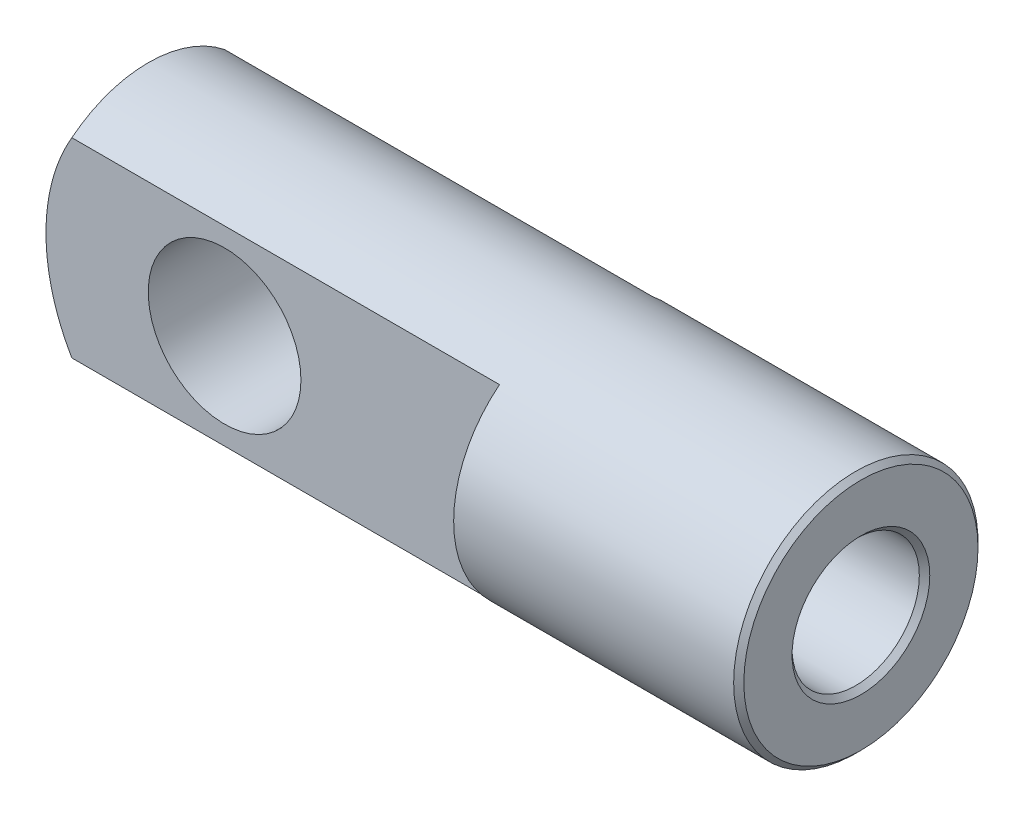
ISO-10303-21;
HEADER;
FILE_DESCRIPTION(('STEP AP214'),'2;1');
FILE_NAME('part.step','',(''),(''),'','','');
FILE_SCHEMA(('AUTOMOTIVE_DESIGN { 1 0 10303 214 1 1 1 1 }'));
ENDSEC;
DATA;
#1=APPLICATION_CONTEXT('core data for automotive mechanical design processes');
#2=APPLICATION_PROTOCOL_DEFINITION('international standard','automotive_design',2000,#1);
#3=PRODUCT_CONTEXT('',#1,'mechanical');
#4=PRODUCT('Part','Part','',(#3));
#5=PRODUCT_RELATED_PRODUCT_CATEGORY('part','',(#4));
#6=PRODUCT_DEFINITION_FORMATION('','',#4);
#7=PRODUCT_DEFINITION_CONTEXT('part definition',#1,'design');
#8=PRODUCT_DEFINITION('design','',#6,#7);
#9=PRODUCT_DEFINITION_SHAPE('','',#8);
#10=(LENGTH_UNIT() NAMED_UNIT(*) SI_UNIT(.MILLI.,.METRE.));
#11=(NAMED_UNIT(*) PLANE_ANGLE_UNIT() SI_UNIT($,.RADIAN.));
#12=(NAMED_UNIT(*) SI_UNIT($,.STERADIAN.) SOLID_ANGLE_UNIT());
#13=UNCERTAINTY_MEASURE_WITH_UNIT(LENGTH_MEASURE(1.E-05),#10,'distance_accuracy_value','');
#14=(GEOMETRIC_REPRESENTATION_CONTEXT(3) GLOBAL_UNCERTAINTY_ASSIGNED_CONTEXT((#13)) GLOBAL_UNIT_ASSIGNED_CONTEXT((#10,
#11,#12)) REPRESENTATION_CONTEXT('',''));
#15=CARTESIAN_POINT('',(0.,0.,0.));
#16=DIRECTION('',(0.,0.,1.));
#17=DIRECTION('',(1.,0.,0.));
#18=AXIS2_PLACEMENT_3D('',#15,#16,#17);
#19=CARTESIAN_POINT('',(-108.,0.,0.));
#20=DIRECTION('',(-1.,0.,0.));
#21=DIRECTION('',(0.,1.,0.));
#22=AXIS2_PLACEMENT_3D('',#19,#20,#21);
#23=SPHERICAL_SURFACE('',#22,40.);
#24=CARTESIAN_POINT('',(-148.,0.,0.));
#25=VERTEX_POINT('',#24);
#26=VERTEX_LOOP('',#25);
#27=FACE_BOUND('',#26,.T.);
#28=CARTESIAN_POINT('',(-140.,0.,0.));
#29=DIRECTION('',(-1.,0.,0.));
#30=DIRECTION('',(0.,0.,1.));
#31=AXIS2_PLACEMENT_3D('',#28,#29,#30);
#32=CIRCLE('',#31,24.);
#33=CARTESIAN_POINT('',(-140.,18.7349939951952,15.));
#34=VERTEX_POINT('',#33);
#35=CARTESIAN_POINT('',(-140.,18.7349939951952,-15.));
#36=VERTEX_POINT('',#35);
#37=EDGE_CURVE('E122',#34,#36,#32,.T.);
#38=ORIENTED_EDGE('',*,*,#37,.T.);
#39=CARTESIAN_POINT('',(-108.,0.,-15.));
#40=DIRECTION('',(0.,0.,1.));
#41=DIRECTION('',(1.,0.,0.));
#42=AXIS2_PLACEMENT_3D('',#39,#40,#41);
#43=CIRCLE('',#42,37.0809924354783);
#44=CARTESIAN_POINT('',(-140.,-18.7349939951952,-15.));
#45=VERTEX_POINT('',#44);
#46=EDGE_CURVE('E112',#36,#45,#43,.T.);
#47=ORIENTED_EDGE('',*,*,#46,.T.);
#48=CARTESIAN_POINT('',(-140.,-18.7349939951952,15.));
#49=VERTEX_POINT('',#48);
#50=EDGE_CURVE('E121',#45,#49,#32,.T.);
#51=ORIENTED_EDGE('',*,*,#50,.T.);
#52=CARTESIAN_POINT('',(-108.,0.,15.));
#53=DIRECTION('',(0.,0.,-1.));
#54=DIRECTION('',(-1.,0.,0.));
#55=AXIS2_PLACEMENT_3D('',#52,#53,#54);
#56=CIRCLE('',#55,37.0809924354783);
#57=EDGE_CURVE('E108',#49,#34,#56,.T.);
#58=ORIENTED_EDGE('',*,*,#57,.T.);
#59=EDGE_LOOP('',(#38,#47,#51,#58));
#60=FACE_BOUND('',#59,.T.);
#61=ADVANCED_FACE('F42',(#27,#60),#23,.T.);
#62=CARTESIAN_POINT('',(-148.,0.,0.));
#63=DIRECTION('',(-1.,0.,0.));
#64=DIRECTION('',(0.,0.,1.));
#65=AXIS2_PLACEMENT_3D('',#62,#63,#64);
#66=CYLINDRICAL_SURFACE('',#65,24.);
#67=CARTESIAN_POINT('',(-56.,0.,0.));
#68=DIRECTION('',(1.,0.,0.));
#69=DIRECTION('',(0.,0.,-1.));
#70=AXIS2_PLACEMENT_3D('',#67,#68,#69);
#71=CIRCLE('',#70,24.);
#72=CARTESIAN_POINT('',(-56.,-18.7349939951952,-15.));
#73=VERTEX_POINT('',#72);
#74=CARTESIAN_POINT('',(-56.,18.7349939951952,-15.));
#75=VERTEX_POINT('',#74);
#76=EDGE_CURVE('E49',#73,#75,#71,.T.);
#77=ORIENTED_EDGE('',*,*,#76,.T.);
#78=DIRECTION('',(-1.,0.,0.));
#79=VECTOR('',#78,1.);
#80=CARTESIAN_POINT('',(-148.,18.7349939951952,-15.));
#81=LINE('',#80,#79);
#82=EDGE_CURVE('E12',#75,#36,#81,.T.);
#83=ORIENTED_EDGE('',*,*,#82,.T.);
#84=ORIENTED_EDGE('',*,*,#37,.F.);
#85=DIRECTION('',(-1.,0.,0.));
#86=VECTOR('',#85,1.);
#87=CARTESIAN_POINT('',(-148.,18.7349939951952,15.));
#88=LINE('',#87,#86);
#89=CARTESIAN_POINT('',(-56.,18.7349939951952,15.));
#90=VERTEX_POINT('',#89);
#91=EDGE_CURVE('E125',#34,#90,#88,.F.);
#92=ORIENTED_EDGE('',*,*,#91,.T.);
#93=CARTESIAN_POINT('',(-56.,0.,0.));
#94=DIRECTION('',(1.,0.,0.));
#95=DIRECTION('',(0.,0.,-1.));
#96=AXIS2_PLACEMENT_3D('',#93,#94,#95);
#97=CIRCLE('',#96,24.);
#98=CARTESIAN_POINT('',(-56.,-18.7349939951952,15.));
#99=VERTEX_POINT('',#98);
#100=EDGE_CURVE('E128',#90,#99,#97,.T.);
#101=ORIENTED_EDGE('',*,*,#100,.T.);
#102=DIRECTION('',(-1.,0.,0.));
#103=VECTOR('',#102,1.);
#104=CARTESIAN_POINT('',(-148.,-18.7349939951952,15.));
#105=LINE('',#104,#103);
#106=EDGE_CURVE('E131',#99,#49,#105,.T.);
#107=ORIENTED_EDGE('',*,*,#106,.T.);
#108=ORIENTED_EDGE('',*,*,#50,.F.);
#109=DIRECTION('',(-1.,0.,0.));
#110=VECTOR('',#109,1.);
#111=CARTESIAN_POINT('',(-148.,-18.7349939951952,-15.));
#112=LINE('',#111,#110);
#113=EDGE_CURVE('E134',#45,#73,#112,.F.);
#114=ORIENTED_EDGE('',*,*,#113,.T.);
#115=EDGE_LOOP('',(#77,#83,#84,#92,#101,#107,#108,#114));
#116=FACE_BOUND('',#115,.T.);
#117=CARTESIAN_POINT('',(-1.,0.,0.));
#118=DIRECTION('',(-1.,0.,0.));
#119=DIRECTION('',(0.,0.,1.));
#120=AXIS2_PLACEMENT_3D('',#117,#118,#119);
#121=CIRCLE('',#120,24.);
#122=CARTESIAN_POINT('',(-1.,0.,24.));
#123=VERTEX_POINT('',#122);
#124=EDGE_CURVE('E118',#123,#123,#121,.T.);
#125=ORIENTED_EDGE('',*,*,#124,.T.);
#126=EDGE_LOOP('',(#125));
#127=FACE_BOUND('',#126,.T.);
#128=ADVANCED_FACE('F138',(#116,#127),#66,.T.);
#129=CARTESIAN_POINT('',(0.,0.,0.));
#130=DIRECTION('',(-1.,0.,0.));
#131=DIRECTION('',(0.,0.,1.));
#132=AXIS2_PLACEMENT_3D('',#129,#130,#131);
#133=CONICAL_SURFACE('',#132,23.,0.785398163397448);
#134=ORIENTED_EDGE('',*,*,#124,.F.);
#135=EDGE_LOOP('',(#134));
#136=FACE_BOUND('',#135,.T.);
#137=CARTESIAN_POINT('',(0.,0.,0.));
#138=DIRECTION('',(-1.,0.,0.));
#139=DIRECTION('',(0.,0.,1.));
#140=AXIS2_PLACEMENT_3D('',#137,#138,#139);
#141=CIRCLE('',#140,23.);
#142=CARTESIAN_POINT('',(0.,0.,23.));
#143=VERTEX_POINT('',#142);
#144=EDGE_CURVE('E115',#143,#143,#141,.T.);
#145=ORIENTED_EDGE('',*,*,#144,.T.);
#146=EDGE_LOOP('',(#145));
#147=FACE_BOUND('',#146,.T.);
#148=ADVANCED_FACE('F162',(#136,#147),#133,.T.);
#149=CARTESIAN_POINT('',(0.,0.,0.));
#150=DIRECTION('',(-1.,0.,0.));
#151=DIRECTION('',(0.,0.,1.));
#152=AXIS2_PLACEMENT_3D('',#149,#150,#151);
#153=PLANE('',#152);
#154=CARTESIAN_POINT('',(0.,0.,0.));
#155=DIRECTION('',(1.,0.,0.));
#156=DIRECTION('',(0.,0.,-1.));
#157=AXIS2_PLACEMENT_3D('',#154,#155,#156);
#158=CIRCLE('',#157,13.525);
#159=CARTESIAN_POINT('',(0.,0.,-13.525));
#160=VERTEX_POINT('',#159);
#161=EDGE_CURVE('E100',#160,#160,#158,.T.);
#162=ORIENTED_EDGE('',*,*,#161,.F.);
#163=EDGE_LOOP('',(#162));
#164=FACE_BOUND('',#163,.T.);
#165=ORIENTED_EDGE('',*,*,#144,.F.);
#166=EDGE_LOOP('',(#165));
#167=FACE_BOUND('',#166,.T.);
#168=ADVANCED_FACE('F169',(#164,#167),#153,.F.);
#169=CARTESIAN_POINT('',(-148.,-30.,15.));
#170=DIRECTION('',(0.,0.,-1.));
#171=DIRECTION('',(-1.,0.,0.));
#172=AXIS2_PLACEMENT_3D('',#169,#170,#171);
#173=PLANE('',#172);
#174=CARTESIAN_POINT('',(-110.,0.,15.));
#175=DIRECTION('',(0.,0.,1.));
#176=DIRECTION('',(1.,0.,0.));
#177=AXIS2_PLACEMENT_3D('',#174,#175,#176);
#178=CIRCLE('',#177,15.);
#179=CARTESIAN_POINT('',(-95.,0.,15.));
#180=VERTEX_POINT('',#179);
#181=EDGE_CURVE('E93',#180,#180,#178,.T.);
#182=ORIENTED_EDGE('',*,*,#181,.F.);
#183=EDGE_LOOP('',(#182));
#184=FACE_BOUND('',#183,.T.);
#185=DIRECTION('',(0.,1.,0.));
#186=VECTOR('',#185,1.);
#187=CARTESIAN_POINT('',(-56.,-30.,15.));
#188=LINE('',#187,#186);
#189=EDGE_CURVE('E105',#99,#90,#188,.T.);
#190=ORIENTED_EDGE('',*,*,#189,.T.);
#191=ORIENTED_EDGE('',*,*,#91,.F.);
#192=ORIENTED_EDGE('',*,*,#57,.F.);
#193=ORIENTED_EDGE('',*,*,#106,.F.);
#194=EDGE_LOOP('',(#190,#191,#192,#193));
#195=FACE_BOUND('',#194,.T.);
#196=ADVANCED_FACE('F154',(#184,#195),#173,.F.);
#197=CARTESIAN_POINT('',(-56.,-30.,15.));
#198=DIRECTION('',(1.,0.,0.));
#199=DIRECTION('',(0.,0.,-1.));
#200=AXIS2_PLACEMENT_3D('',#197,#198,#199);
#201=PLANE('',#200);
#202=ORIENTED_EDGE('',*,*,#189,.F.);
#203=ORIENTED_EDGE('',*,*,#100,.F.);
#204=EDGE_LOOP('',(#202,#203));
#205=FACE_BOUND('',#204,.T.);
#206=ADVANCED_FACE('F146',(#205),#201,.F.);
#207=CARTESIAN_POINT('',(-56.,-30.,-15.));
#208=DIRECTION('',(1.,0.,0.));
#209=DIRECTION('',(0.,0.,-1.));
#210=AXIS2_PLACEMENT_3D('',#207,#208,#209);
#211=PLANE('',#210);
#212=DIRECTION('',(0.,1.,0.));
#213=VECTOR('',#212,1.);
#214=CARTESIAN_POINT('',(-56.,-30.,-15.));
#215=LINE('',#214,#213);
#216=EDGE_CURVE('E59',#73,#75,#215,.T.);
#217=ORIENTED_EDGE('',*,*,#216,.T.);
#218=ORIENTED_EDGE('',*,*,#76,.F.);
#219=EDGE_LOOP('',(#217,#218));
#220=FACE_BOUND('',#219,.T.);
#221=ADVANCED_FACE('F143',(#220),#211,.F.);
#222=CARTESIAN_POINT('',(-148.,-30.,-15.));
#223=DIRECTION('',(0.,0.,1.));
#224=DIRECTION('',(1.,0.,0.));
#225=AXIS2_PLACEMENT_3D('',#222,#223,#224);
#226=PLANE('',#225);
#227=CARTESIAN_POINT('',(-110.,0.,-15.));
#228=DIRECTION('',(0.,0.,1.));
#229=DIRECTION('',(1.,0.,0.));
#230=AXIS2_PLACEMENT_3D('',#227,#228,#229);
#231=CIRCLE('',#230,15.);
#232=CARTESIAN_POINT('',(-95.,0.,-15.));
#233=VERTEX_POINT('',#232);
#234=EDGE_CURVE('E97',#233,#233,#231,.T.);
#235=ORIENTED_EDGE('',*,*,#234,.T.);
#236=EDGE_LOOP('',(#235));
#237=FACE_BOUND('',#236,.T.);
#238=ORIENTED_EDGE('',*,*,#216,.F.);
#239=ORIENTED_EDGE('',*,*,#113,.F.);
#240=ORIENTED_EDGE('',*,*,#46,.F.);
#241=ORIENTED_EDGE('',*,*,#82,.F.);
#242=EDGE_LOOP('',(#238,#239,#240,#241));
#243=FACE_BOUND('',#242,.T.);
#244=ADVANCED_FACE('F145',(#237,#243),#226,.F.);
#245=CARTESIAN_POINT('',(-110.,0.,-15.));
#246=DIRECTION('',(0.,0.,1.));
#247=DIRECTION('',(1.,0.,0.));
#248=AXIS2_PLACEMENT_3D('',#245,#246,#247);
#249=CYLINDRICAL_SURFACE('',#248,15.);
#250=ORIENTED_EDGE('',*,*,#234,.F.);
#251=EDGE_LOOP('',(#250));
#252=FACE_BOUND('',#251,.T.);
#253=ORIENTED_EDGE('',*,*,#181,.T.);
#254=EDGE_LOOP('',(#253));
#255=FACE_BOUND('',#254,.T.);
#256=ADVANCED_FACE('F87',(#252,#255),#249,.F.);
#257=CARTESIAN_POINT('',(-35.5,0.,0.));
#258=DIRECTION('',(1.,0.,0.));
#259=DIRECTION('',(0.,0.,-1.));
#260=AXIS2_PLACEMENT_3D('',#257,#258,#259);
#261=CONICAL_SURFACE('',#260,12.5,1.02974425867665);
#262=CARTESIAN_POINT('',(-43.0107577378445,0.,0.));
#263=VERTEX_POINT('',#262);
#264=VERTEX_LOOP('',#263);
#265=FACE_BOUND('',#264,.T.);
#266=CARTESIAN_POINT('',(-35.5,0.,0.));
#267=DIRECTION('',(1.,0.,0.));
#268=DIRECTION('',(0.,0.,-1.));
#269=AXIS2_PLACEMENT_3D('',#266,#267,#268);
#270=CIRCLE('',#269,12.5);
#271=CARTESIAN_POINT('',(-35.5,0.,-12.5));
#272=VERTEX_POINT('',#271);
#273=EDGE_CURVE('E91',#272,#272,#270,.T.);
#274=ORIENTED_EDGE('',*,*,#273,.T.);
#275=EDGE_LOOP('',(#274));
#276=FACE_BOUND('',#275,.T.);
#277=ADVANCED_FACE('F83',(#265,#276),#261,.F.);
#278=CARTESIAN_POINT('',(0.,0.,0.));
#279=DIRECTION('',(1.,0.,0.));
#280=DIRECTION('',(0.,0.,-1.));
#281=AXIS2_PLACEMENT_3D('',#278,#279,#280);
#282=CYLINDRICAL_SURFACE('',#281,12.5);
#283=ORIENTED_EDGE('',*,*,#273,.F.);
#284=EDGE_LOOP('',(#283));
#285=FACE_BOUND('',#284,.T.);
#286=CARTESIAN_POINT('',(-1.02500000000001,0.,0.));
#287=DIRECTION('',(1.,0.,0.));
#288=DIRECTION('',(0.,0.,-1.));
#289=AXIS2_PLACEMENT_3D('',#286,#287,#288);
#290=CIRCLE('',#289,12.5);
#291=CARTESIAN_POINT('',(-1.02500000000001,0.,-12.5));
#292=VERTEX_POINT('',#291);
#293=EDGE_CURVE('E94',#292,#292,#290,.T.);
#294=ORIENTED_EDGE('',*,*,#293,.T.);
#295=EDGE_LOOP('',(#294));
#296=FACE_BOUND('',#295,.T.);
#297=ADVANCED_FACE('F86',(#285,#296),#282,.F.);
#298=CARTESIAN_POINT('',(0.,0.,0.));
#299=DIRECTION('',(1.,0.,0.));
#300=DIRECTION('',(0.,0.,-1.));
#301=AXIS2_PLACEMENT_3D('',#298,#299,#300);
#302=CONICAL_SURFACE('',#301,13.525,0.785398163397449);
#303=ORIENTED_EDGE('',*,*,#293,.F.);
#304=EDGE_LOOP('',(#303));
#305=FACE_BOUND('',#304,.T.);
#306=ORIENTED_EDGE('',*,*,#161,.T.);
#307=EDGE_LOOP('',(#306));
#308=FACE_BOUND('',#307,.T.);
#309=ADVANCED_FACE('F215',(#305,#308),#302,.F.);
#310=CLOSED_SHELL('',(#61,#128,#148,#168,#196,#206,#221,#244,#256,#277,#297,#309));
#311=MANIFOLD_SOLID_BREP('B2',#310);
#312=ADVANCED_BREP_SHAPE_REPRESENTATION('',(#18,#311),#14);
#313=SHAPE_DEFINITION_REPRESENTATION(#9,#312);
ENDSEC;
END-ISO-10303-21;
